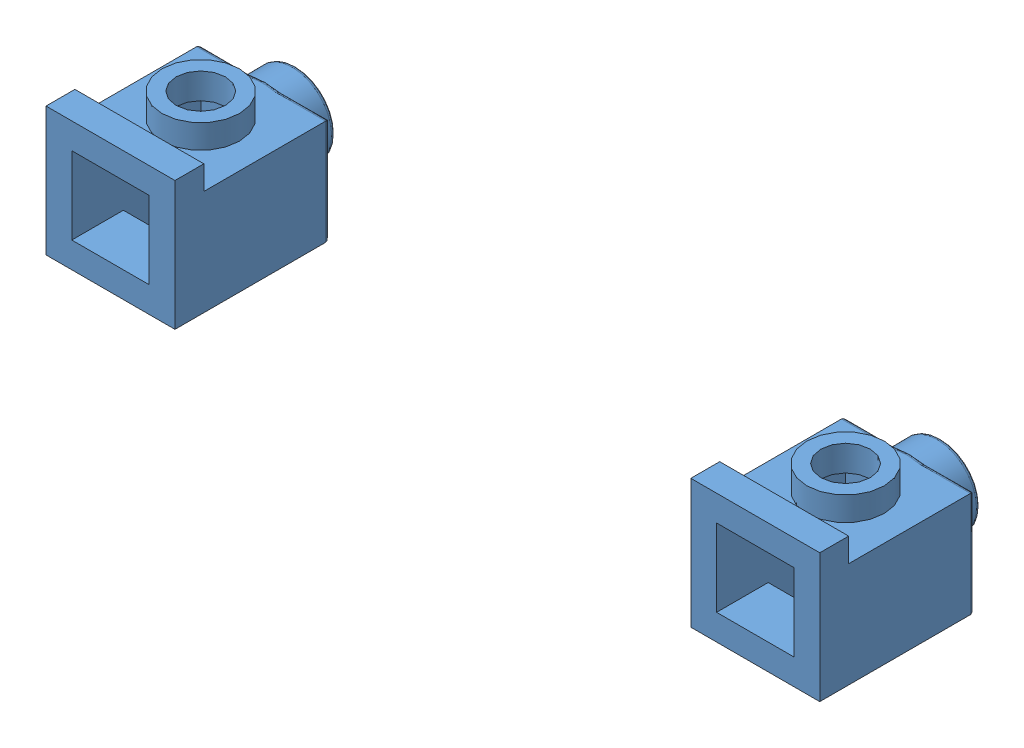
SolidWorks assembly cage.sldasm, configuration Default (file format 4400). Lengths in mm.
Overall size (47.62 11.54 11.43).
3 component instances, 2 part files, 6 mates.
Components (placement in the parent):
- 6x1 open end-1: 6x1 open end.SLDPRT [White] at (-16.1224 71.7632 0) size (47.62 5.08 7.94)
- 1-A block-1: 1-A block.SLDPRT [Blue] at (-35.9662 69.2677 5.5563) x (1 0 0) z (0 1 0) size (7.94 11.43 7.94)
- 1-A block-2: 1-A block.SLDPRT [Blue] at (3.7213 69.2677 5.5563) x (1 0 0) z (0 1 0) size (7.94 11.43 7.94)
Mates (geometry in assembly coordinates):
- Concentric1: concentric anti-aligned: cylinder of 6x1 open end-1 through (-35.9662 71.7632 0) axis (0 1 0) radius 2.3495; cylinder of 1-A block-1 through (-35.9662 79.9896 0) axis (0 -1 0) radius 2.3876
- Parallel1: parallel aligned: plane of 6x1 open end-1 through (-0.2474 74.9382 3.9688) normal (0 0 1); plane of 1-A block-1 through (-39.9349 73.2364 5.5563) normal (0 0 1)
- Concentric2: concentric anti-aligned: cylinder of 6x1 open end-1 through (3.7213 71.7632 0) axis (0 1 0) radius 2.3495; cylinder of 1-A block-2 through (3.7213 79.9896 0) axis (0 -1 0) radius 2.3876
- Parallel2: parallel aligned: plane of 6x1 open end-1 through (-0.2474 74.9382 3.9688) normal (0 0 1); plane of 1-A block-2 through (-0.2474 73.2364 5.5563) normal (0 0 1)
- Coincident1: coincident anti-aligned: plane of 6x1 open end-1 through (-31.9974 71.7632 3.9688) normal (0 -1 0); plane of 1-A block-2 through (-0.2474 71.7632 3.7782) normal (0 1 0)
- Coincident2: coincident anti-aligned: plane of 6x1 open end-1 through (-31.9974 71.7632 3.9688) normal (0 -1 0); plane of 1-A block-1 through (-39.9349 71.7632 3.7782) normal (0 1 0)
